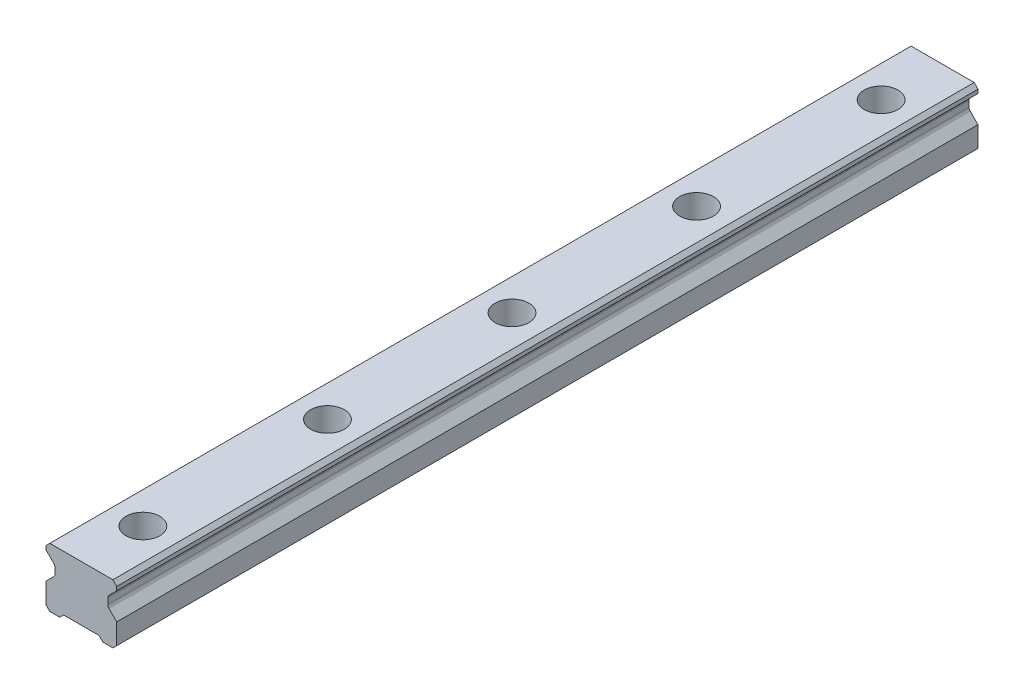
ISO-10303-21;
HEADER;
FILE_DESCRIPTION(('STEP AP214'),'2;1');
FILE_NAME('part.step','',(''),(''),'','','');
FILE_SCHEMA(('AUTOMOTIVE_DESIGN { 1 0 10303 214 1 1 1 1 }'));
ENDSEC;
DATA;
#1=APPLICATION_CONTEXT('core data for automotive mechanical design processes');
#2=APPLICATION_PROTOCOL_DEFINITION('international standard','automotive_design',2000,#1);
#3=PRODUCT_CONTEXT('',#1,'mechanical');
#4=PRODUCT('Part','Part','',(#3));
#5=PRODUCT_RELATED_PRODUCT_CATEGORY('part','',(#4));
#6=PRODUCT_DEFINITION_FORMATION('','',#4);
#7=PRODUCT_DEFINITION_CONTEXT('part definition',#1,'design');
#8=PRODUCT_DEFINITION('design','',#6,#7);
#9=PRODUCT_DEFINITION_SHAPE('','',#8);
#10=(LENGTH_UNIT() NAMED_UNIT(*) SI_UNIT(.MILLI.,.METRE.));
#11=(NAMED_UNIT(*) PLANE_ANGLE_UNIT() SI_UNIT($,.RADIAN.));
#12=(NAMED_UNIT(*) SI_UNIT($,.STERADIAN.) SOLID_ANGLE_UNIT());
#13=UNCERTAINTY_MEASURE_WITH_UNIT(LENGTH_MEASURE(1.E-05),#10,'distance_accuracy_value','');
#14=(GEOMETRIC_REPRESENTATION_CONTEXT(3) GLOBAL_UNCERTAINTY_ASSIGNED_CONTEXT((#13)) GLOBAL_UNIT_ASSIGNED_CONTEXT((#10,
#11,#12)) REPRESENTATION_CONTEXT('',''));
#15=CARTESIAN_POINT('',(0.,0.,0.));
#16=DIRECTION('',(0.,0.,1.));
#17=DIRECTION('',(1.,0.,0.));
#18=AXIS2_PLACEMENT_3D('',#15,#16,#17);
#19=CARTESIAN_POINT('',(0.,10.2,-120.));
#20=DIRECTION('',(0.,1.,0.));
#21=DIRECTION('',(0.,0.,1.));
#22=AXIS2_PLACEMENT_3D('',#19,#20,#21);
#23=PLANE('',#22);
#24=CARTESIAN_POINT('',(0.,10.2,-120.));
#25=DIRECTION('',(0.,1.,0.));
#26=DIRECTION('',(0.,0.,1.));
#27=AXIS2_PLACEMENT_3D('',#24,#25,#26);
#28=CIRCLE('',#27,3.5);
#29=CARTESIAN_POINT('',(0.,10.2,-116.5));
#30=VERTEX_POINT('',#29);
#31=EDGE_CURVE('E381',#30,#30,#28,.T.);
#32=ORIENTED_EDGE('',*,*,#31,.F.);
#33=EDGE_LOOP('',(#32));
#34=FACE_BOUND('',#33,.T.);
#35=CARTESIAN_POINT('',(0.,10.2,-120.));
#36=DIRECTION('',(0.,1.,0.));
#37=DIRECTION('',(0.,0.,1.));
#38=AXIS2_PLACEMENT_3D('',#35,#36,#37);
#39=CIRCLE('',#38,5.5);
#40=CARTESIAN_POINT('',(0.,10.2,-114.5));
#41=VERTEX_POINT('',#40);
#42=EDGE_CURVE('E11',#41,#41,#39,.T.);
#43=ORIENTED_EDGE('',*,*,#42,.T.);
#44=EDGE_LOOP('',(#43));
#45=FACE_BOUND('',#44,.T.);
#46=ADVANCED_FACE('F39',(#34,#45),#23,.T.);
#47=CARTESIAN_POINT('',(0.,10.2,-120.));
#48=DIRECTION('',(0.,1.,0.));
#49=DIRECTION('',(0.,0.,1.));
#50=AXIS2_PLACEMENT_3D('',#47,#48,#49);
#51=CYLINDRICAL_SURFACE('',#50,5.5);
#52=ORIENTED_EDGE('',*,*,#42,.F.);
#53=EDGE_LOOP('',(#52));
#54=FACE_BOUND('',#53,.T.);
#55=CARTESIAN_POINT('',(0.,19.2,-120.));
#56=DIRECTION('',(0.,1.,0.));
#57=DIRECTION('',(0.,0.,1.));
#58=AXIS2_PLACEMENT_3D('',#55,#56,#57);
#59=CIRCLE('',#58,5.5);
#60=CARTESIAN_POINT('',(0.,19.2,-114.5));
#61=VERTEX_POINT('',#60);
#62=EDGE_CURVE('E48',#61,#61,#59,.T.);
#63=ORIENTED_EDGE('',*,*,#62,.T.);
#64=EDGE_LOOP('',(#63));
#65=FACE_BOUND('',#64,.T.);
#66=ADVANCED_FACE('F635',(#54,#65),#51,.F.);
#67=CARTESIAN_POINT('',(0.,10.2,-60.));
#68=DIRECTION('',(0.,1.,0.));
#69=DIRECTION('',(0.,0.,1.));
#70=AXIS2_PLACEMENT_3D('',#67,#68,#69);
#71=PLANE('',#70);
#72=CARTESIAN_POINT('',(0.,10.2,-60.));
#73=DIRECTION('',(0.,1.,0.));
#74=DIRECTION('',(0.,0.,1.));
#75=AXIS2_PLACEMENT_3D('',#72,#73,#74);
#76=CIRCLE('',#75,3.5);
#77=CARTESIAN_POINT('',(0.,10.2,-56.5));
#78=VERTEX_POINT('',#77);
#79=EDGE_CURVE('E385',#78,#78,#76,.T.);
#80=ORIENTED_EDGE('',*,*,#79,.F.);
#81=EDGE_LOOP('',(#80));
#82=FACE_BOUND('',#81,.T.);
#83=CARTESIAN_POINT('',(0.,10.2,-60.));
#84=DIRECTION('',(0.,1.,0.));
#85=DIRECTION('',(0.,0.,1.));
#86=AXIS2_PLACEMENT_3D('',#83,#84,#85);
#87=CIRCLE('',#86,5.5);
#88=CARTESIAN_POINT('',(0.,10.2,-54.5));
#89=VERTEX_POINT('',#88);
#90=EDGE_CURVE('E366',#89,#89,#87,.T.);
#91=ORIENTED_EDGE('',*,*,#90,.T.);
#92=EDGE_LOOP('',(#91));
#93=FACE_BOUND('',#92,.T.);
#94=ADVANCED_FACE('F640',(#82,#93),#71,.T.);
#95=CARTESIAN_POINT('',(0.,10.2,-60.));
#96=DIRECTION('',(0.,1.,0.));
#97=DIRECTION('',(0.,0.,1.));
#98=AXIS2_PLACEMENT_3D('',#95,#96,#97);
#99=CYLINDRICAL_SURFACE('',#98,5.5);
#100=ORIENTED_EDGE('',*,*,#90,.F.);
#101=EDGE_LOOP('',(#100));
#102=FACE_BOUND('',#101,.T.);
#103=CARTESIAN_POINT('',(0.,19.2,-60.));
#104=DIRECTION('',(0.,1.,0.));
#105=DIRECTION('',(0.,0.,1.));
#106=AXIS2_PLACEMENT_3D('',#103,#104,#105);
#107=CIRCLE('',#106,5.5);
#108=CARTESIAN_POINT('',(0.,19.2,-54.5));
#109=VERTEX_POINT('',#108);
#110=EDGE_CURVE('E362',#109,#109,#107,.T.);
#111=ORIENTED_EDGE('',*,*,#110,.T.);
#112=EDGE_LOOP('',(#111));
#113=FACE_BOUND('',#112,.T.);
#114=ADVANCED_FACE('F685',(#102,#113),#99,.F.);
#115=CARTESIAN_POINT('',(0.,10.2,0.));
#116=DIRECTION('',(0.,1.,0.));
#117=DIRECTION('',(0.,0.,1.));
#118=AXIS2_PLACEMENT_3D('',#115,#116,#117);
#119=PLANE('',#118);
#120=CARTESIAN_POINT('',(0.,10.2,0.));
#121=DIRECTION('',(0.,1.,0.));
#122=DIRECTION('',(0.,0.,1.));
#123=AXIS2_PLACEMENT_3D('',#120,#121,#122);
#124=CIRCLE('',#123,3.5);
#125=CARTESIAN_POINT('',(0.,10.2,3.50000000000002));
#126=VERTEX_POINT('',#125);
#127=EDGE_CURVE('E399',#126,#126,#124,.T.);
#128=ORIENTED_EDGE('',*,*,#127,.F.);
#129=EDGE_LOOP('',(#128));
#130=FACE_BOUND('',#129,.T.);
#131=CARTESIAN_POINT('',(0.,10.2,0.));
#132=DIRECTION('',(0.,1.,0.));
#133=DIRECTION('',(0.,0.,1.));
#134=AXIS2_PLACEMENT_3D('',#131,#132,#133);
#135=CIRCLE('',#134,5.5);
#136=CARTESIAN_POINT('',(0.,10.2,5.50000000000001));
#137=VERTEX_POINT('',#136);
#138=EDGE_CURVE('E358',#137,#137,#135,.T.);
#139=ORIENTED_EDGE('',*,*,#138,.T.);
#140=EDGE_LOOP('',(#139));
#141=FACE_BOUND('',#140,.T.);
#142=ADVANCED_FACE('F681',(#130,#141),#119,.T.);
#143=CARTESIAN_POINT('',(0.,10.2,0.));
#144=DIRECTION('',(0.,1.,0.));
#145=DIRECTION('',(0.,0.,1.));
#146=AXIS2_PLACEMENT_3D('',#143,#144,#145);
#147=CYLINDRICAL_SURFACE('',#146,5.5);
#148=ORIENTED_EDGE('',*,*,#138,.F.);
#149=EDGE_LOOP('',(#148));
#150=FACE_BOUND('',#149,.T.);
#151=CARTESIAN_POINT('',(0.,19.2,0.));
#152=DIRECTION('',(0.,1.,0.));
#153=DIRECTION('',(0.,0.,1.));
#154=AXIS2_PLACEMENT_3D('',#151,#152,#153);
#155=CIRCLE('',#154,5.5);
#156=CARTESIAN_POINT('',(0.,19.2,5.50000000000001));
#157=VERTEX_POINT('',#156);
#158=EDGE_CURVE('E354',#157,#157,#155,.T.);
#159=ORIENTED_EDGE('',*,*,#158,.T.);
#160=EDGE_LOOP('',(#159));
#161=FACE_BOUND('',#160,.T.);
#162=ADVANCED_FACE('F678',(#150,#161),#147,.F.);
#163=CARTESIAN_POINT('',(11.5,0.,140.));
#164=DIRECTION('',(0.,1.,0.));
#165=DIRECTION('',(-1.,0.,0.));
#166=AXIS2_PLACEMENT_3D('',#163,#164,#165);
#167=PLANE('',#166);
#168=DIRECTION('',(1.,0.,0.));
#169=VECTOR('',#168,1.);
#170=CARTESIAN_POINT('',(11.5,0.,-140.));
#171=LINE('',#170,#169);
#172=CARTESIAN_POINT('',(-10.25,0.,-140.));
#173=VERTEX_POINT('',#172);
#174=CARTESIAN_POINT('',(-7.,0.,-140.));
#175=VERTEX_POINT('',#174);
#176=EDGE_CURVE('E229',#173,#175,#171,.T.);
#177=ORIENTED_EDGE('',*,*,#176,.T.);
#178=DIRECTION('',(0.,0.,1.));
#179=VECTOR('',#178,1.);
#180=CARTESIAN_POINT('',(-7.,0.,-140.));
#181=LINE('',#180,#179);
#182=CARTESIAN_POINT('',(-7.,0.,140.));
#183=VERTEX_POINT('',#182);
#184=EDGE_CURVE('E440',#175,#183,#181,.T.);
#185=ORIENTED_EDGE('',*,*,#184,.T.);
#186=DIRECTION('',(1.,0.,0.));
#187=VECTOR('',#186,1.);
#188=CARTESIAN_POINT('',(11.5,0.,140.));
#189=LINE('',#188,#187);
#190=CARTESIAN_POINT('',(-10.25,0.,140.));
#191=VERTEX_POINT('',#190);
#192=EDGE_CURVE('E510',#191,#183,#189,.T.);
#193=ORIENTED_EDGE('',*,*,#192,.F.);
#194=DIRECTION('',(0.,0.,-1.));
#195=VECTOR('',#194,1.);
#196=CARTESIAN_POINT('',(-10.25,0.,140.));
#197=LINE('',#196,#195);
#198=EDGE_CURVE('E289',#191,#173,#197,.T.);
#199=ORIENTED_EDGE('',*,*,#198,.T.);
#200=EDGE_LOOP('',(#177,#185,#193,#199));
#201=FACE_BOUND('',#200,.T.);
#202=ADVANCED_FACE('F573',(#201),#167,.F.);
#203=CARTESIAN_POINT('',(-11.5,19.2,140.));
#204=DIRECTION('',(1.,0.,0.));
#205=DIRECTION('',(0.,1.,0.));
#206=AXIS2_PLACEMENT_3D('',#203,#204,#205);
#207=PLANE('',#206);
#208=DIRECTION('',(0.,-1.,0.));
#209=VECTOR('',#208,1.);
#210=CARTESIAN_POINT('',(-11.5,19.2,140.));
#211=LINE('',#210,#209);
#212=CARTESIAN_POINT('',(-11.5,17.95,140.));
#213=VERTEX_POINT('',#212);
#214=CARTESIAN_POINT('',(-11.5,16.7,140.));
#215=VERTEX_POINT('',#214);
#216=EDGE_CURVE('E506',#213,#215,#211,.T.);
#217=ORIENTED_EDGE('',*,*,#216,.F.);
#218=DIRECTION('',(0.,0.,-1.));
#219=VECTOR('',#218,1.);
#220=CARTESIAN_POINT('',(-11.5,17.95,140.));
#221=LINE('',#220,#219);
#222=CARTESIAN_POINT('',(-11.5,17.95,-140.));
#223=VERTEX_POINT('',#222);
#224=EDGE_CURVE('E251',#213,#223,#221,.T.);
#225=ORIENTED_EDGE('',*,*,#224,.T.);
#226=DIRECTION('',(0.,-1.,0.));
#227=VECTOR('',#226,1.);
#228=CARTESIAN_POINT('',(-11.5,19.2,-140.));
#229=LINE('',#228,#227);
#230=CARTESIAN_POINT('',(-11.5,16.7,-140.));
#231=VERTEX_POINT('',#230);
#232=EDGE_CURVE('E230',#223,#231,#229,.T.);
#233=ORIENTED_EDGE('',*,*,#232,.T.);
#234=DIRECTION('',(0.,0.,1.));
#235=VECTOR('',#234,1.);
#236=CARTESIAN_POINT('',(-11.5,16.7,-140.));
#237=LINE('',#236,#235);
#238=EDGE_CURVE('E461',#231,#215,#237,.T.);
#239=ORIENTED_EDGE('',*,*,#238,.T.);
#240=EDGE_LOOP('',(#217,#225,#233,#239));
#241=FACE_BOUND('',#240,.T.);
#242=ADVANCED_FACE('F535',(#241),#207,.F.);
#243=CARTESIAN_POINT('',(11.5,19.2,140.));
#244=DIRECTION('',(-1.,0.,0.));
#245=DIRECTION('',(0.,0.,1.));
#246=AXIS2_PLACEMENT_3D('',#243,#244,#245);
#247=PLANE('',#246);
#248=DIRECTION('',(0.,1.,0.));
#249=VECTOR('',#248,1.);
#250=CARTESIAN_POINT('',(11.5,19.2,140.));
#251=LINE('',#250,#249);
#252=CARTESIAN_POINT('',(11.5,1.25,140.));
#253=VERTEX_POINT('',#252);
#254=CARTESIAN_POINT('',(11.5,7.95,140.));
#255=VERTEX_POINT('',#254);
#256=EDGE_CURVE('E515',#253,#255,#251,.T.);
#257=ORIENTED_EDGE('',*,*,#256,.F.);
#258=DIRECTION('',(0.,0.,-1.));
#259=VECTOR('',#258,1.);
#260=CARTESIAN_POINT('',(11.5,1.25,140.));
#261=LINE('',#260,#259);
#262=CARTESIAN_POINT('',(11.5,1.25,-140.));
#263=VERTEX_POINT('',#262);
#264=EDGE_CURVE('E296',#253,#263,#261,.T.);
#265=ORIENTED_EDGE('',*,*,#264,.T.);
#266=DIRECTION('',(0.,1.,0.));
#267=VECTOR('',#266,1.);
#268=CARTESIAN_POINT('',(11.5,19.2,-140.));
#269=LINE('',#268,#267);
#270=CARTESIAN_POINT('',(11.5,7.95,-140.));
#271=VERTEX_POINT('',#270);
#272=EDGE_CURVE('E242',#263,#271,#269,.T.);
#273=ORIENTED_EDGE('',*,*,#272,.T.);
#274=DIRECTION('',(0.,0.,1.));
#275=VECTOR('',#274,1.);
#276=CARTESIAN_POINT('',(11.5,7.95,-140.));
#277=LINE('',#276,#275);
#278=EDGE_CURVE('E491',#271,#255,#277,.T.);
#279=ORIENTED_EDGE('',*,*,#278,.T.);
#280=EDGE_LOOP('',(#257,#265,#273,#279));
#281=FACE_BOUND('',#280,.T.);
#282=ADVANCED_FACE('F614',(#281),#247,.F.);
#283=CARTESIAN_POINT('',(-11.5,7.95,-140.));
#284=VERTEX_POINT('',#283);
#285=CARTESIAN_POINT('',(-11.5,1.25,-140.));
#286=VERTEX_POINT('',#285);
#287=EDGE_CURVE('E238',#284,#286,#229,.T.);
#288=ORIENTED_EDGE('',*,*,#287,.T.);
#289=DIRECTION('',(0.,0.,1.));
#290=VECTOR('',#289,1.);
#291=CARTESIAN_POINT('',(-11.5,1.25,140.));
#292=LINE('',#291,#290);
#293=CARTESIAN_POINT('',(-11.5,1.25,140.));
#294=VERTEX_POINT('',#293);
#295=EDGE_CURVE('E293',#286,#294,#292,.T.);
#296=ORIENTED_EDGE('',*,*,#295,.T.);
#297=CARTESIAN_POINT('',(-11.5,7.95,140.));
#298=VERTEX_POINT('',#297);
#299=EDGE_CURVE('E250',#298,#294,#211,.T.);
#300=ORIENTED_EDGE('',*,*,#299,.F.);
#301=DIRECTION('',(0.,0.,1.));
#302=VECTOR('',#301,1.);
#303=CARTESIAN_POINT('',(-11.5,7.95,-140.));
#304=LINE('',#303,#302);
#305=EDGE_CURVE('E473',#284,#298,#304,.T.);
#306=ORIENTED_EDGE('',*,*,#305,.F.);
#307=EDGE_LOOP('',(#288,#296,#300,#306));
#308=FACE_BOUND('',#307,.T.);
#309=ADVANCED_FACE('F563',(#308),#207,.F.);
#310=CARTESIAN_POINT('',(7.,0.,140.));
#311=VERTEX_POINT('',#310);
#312=CARTESIAN_POINT('',(10.25,0.,140.));
#313=VERTEX_POINT('',#312);
#314=EDGE_CURVE('E219',#311,#313,#189,.T.);
#315=ORIENTED_EDGE('',*,*,#314,.F.);
#316=DIRECTION('',(0.,0.,1.));
#317=VECTOR('',#316,1.);
#318=CARTESIAN_POINT('',(7.,0.,-140.));
#319=LINE('',#318,#317);
#320=CARTESIAN_POINT('',(7.,0.,-140.));
#321=VERTEX_POINT('',#320);
#322=EDGE_CURVE('E206',#321,#311,#319,.T.);
#323=ORIENTED_EDGE('',*,*,#322,.F.);
#324=CARTESIAN_POINT('',(10.25,0.,-140.));
#325=VERTEX_POINT('',#324);
#326=EDGE_CURVE('E217',#321,#325,#171,.T.);
#327=ORIENTED_EDGE('',*,*,#326,.T.);
#328=DIRECTION('',(0.,0.,1.));
#329=VECTOR('',#328,1.);
#330=CARTESIAN_POINT('',(10.25,0.,140.));
#331=LINE('',#330,#329);
#332=EDGE_CURVE('E286',#325,#313,#331,.T.);
#333=ORIENTED_EDGE('',*,*,#332,.T.);
#334=EDGE_LOOP('',(#315,#323,#327,#333));
#335=FACE_BOUND('',#334,.T.);
#336=ADVANCED_FACE('F215',(#335),#167,.F.);
#337=CARTESIAN_POINT('',(11.5,16.7,-140.));
#338=VERTEX_POINT('',#337);
#339=CARTESIAN_POINT('',(11.5,17.95,-140.));
#340=VERTEX_POINT('',#339);
#341=EDGE_CURVE('E236',#338,#340,#269,.T.);
#342=ORIENTED_EDGE('',*,*,#341,.T.);
#343=DIRECTION('',(0.,0.,1.));
#344=VECTOR('',#343,1.);
#345=CARTESIAN_POINT('',(11.5,17.95,140.));
#346=LINE('',#345,#344);
#347=CARTESIAN_POINT('',(11.5,17.95,140.));
#348=VERTEX_POINT('',#347);
#349=EDGE_CURVE('E300',#340,#348,#346,.T.);
#350=ORIENTED_EDGE('',*,*,#349,.T.);
#351=CARTESIAN_POINT('',(11.5,16.7,140.));
#352=VERTEX_POINT('',#351);
#353=EDGE_CURVE('E514',#352,#348,#251,.T.);
#354=ORIENTED_EDGE('',*,*,#353,.F.);
#355=DIRECTION('',(0.,0.,1.));
#356=VECTOR('',#355,1.);
#357=CARTESIAN_POINT('',(11.5,16.7,-140.));
#358=LINE('',#357,#356);
#359=EDGE_CURVE('E466',#338,#352,#358,.T.);
#360=ORIENTED_EDGE('',*,*,#359,.F.);
#361=EDGE_LOOP('',(#342,#350,#354,#360));
#362=FACE_BOUND('',#361,.T.);
#363=ADVANCED_FACE('F590',(#362),#247,.F.);
#364=CARTESIAN_POINT('',(11.5,19.2,140.));
#365=DIRECTION('',(0.,-1.,0.));
#366=DIRECTION('',(0.,0.,-1.));
#367=AXIS2_PLACEMENT_3D('',#364,#365,#366);
#368=PLANE('',#367);
#369=CARTESIAN_POINT('',(0.,19.2,60.));
#370=DIRECTION('',(0.,1.,0.));
#371=DIRECTION('',(0.,0.,1.));
#372=AXIS2_PLACEMENT_3D('',#369,#370,#371);
#373=CIRCLE('',#372,5.5);
#374=CARTESIAN_POINT('',(0.,19.2,65.5));
#375=VERTEX_POINT('',#374);
#376=EDGE_CURVE('E403',#375,#375,#373,.T.);
#377=ORIENTED_EDGE('',*,*,#376,.F.);
#378=EDGE_LOOP('',(#377));
#379=FACE_BOUND('',#378,.T.);
#380=CARTESIAN_POINT('',(0.,19.2,120.));
#381=DIRECTION('',(0.,1.,0.));
#382=DIRECTION('',(0.,0.,1.));
#383=AXIS2_PLACEMENT_3D('',#380,#381,#382);
#384=CIRCLE('',#383,5.5);
#385=CARTESIAN_POINT('',(0.,19.2,125.5));
#386=VERTEX_POINT('',#385);
#387=EDGE_CURVE('E419',#386,#386,#384,.T.);
#388=ORIENTED_EDGE('',*,*,#387,.F.);
#389=EDGE_LOOP('',(#388));
#390=FACE_BOUND('',#389,.T.);
#391=DIRECTION('',(-1.,0.,0.));
#392=VECTOR('',#391,1.);
#393=CARTESIAN_POINT('',(11.5,19.2,-140.));
#394=LINE('',#393,#392);
#395=CARTESIAN_POINT('',(10.25,19.2,-140.));
#396=VERTEX_POINT('',#395);
#397=CARTESIAN_POINT('',(-10.25,19.2,-140.));
#398=VERTEX_POINT('',#397);
#399=EDGE_CURVE('E246',#396,#398,#394,.T.);
#400=ORIENTED_EDGE('',*,*,#399,.T.);
#401=DIRECTION('',(0.,0.,1.));
#402=VECTOR('',#401,1.);
#403=CARTESIAN_POINT('',(-10.25,19.2,140.));
#404=LINE('',#403,#402);
#405=CARTESIAN_POINT('',(-10.25,19.2,140.));
#406=VERTEX_POINT('',#405);
#407=EDGE_CURVE('E271',#398,#406,#404,.T.);
#408=ORIENTED_EDGE('',*,*,#407,.T.);
#409=DIRECTION('',(-1.,0.,0.));
#410=VECTOR('',#409,1.);
#411=CARTESIAN_POINT('',(11.5,19.2,140.));
#412=LINE('',#411,#410);
#413=CARTESIAN_POINT('',(10.25,19.2,140.));
#414=VERTEX_POINT('',#413);
#415=EDGE_CURVE('E256',#414,#406,#412,.T.);
#416=ORIENTED_EDGE('',*,*,#415,.F.);
#417=DIRECTION('',(0.,0.,-1.));
#418=VECTOR('',#417,1.);
#419=CARTESIAN_POINT('',(10.25,19.2,140.));
#420=LINE('',#419,#418);
#421=EDGE_CURVE('E267',#414,#396,#420,.T.);
#422=ORIENTED_EDGE('',*,*,#421,.T.);
#423=EDGE_LOOP('',(#400,#408,#416,#422));
#424=FACE_BOUND('',#423,.T.);
#425=ORIENTED_EDGE('',*,*,#158,.F.);
#426=EDGE_LOOP('',(#425));
#427=FACE_BOUND('',#426,.T.);
#428=ORIENTED_EDGE('',*,*,#110,.F.);
#429=EDGE_LOOP('',(#428));
#430=FACE_BOUND('',#429,.T.);
#431=ORIENTED_EDGE('',*,*,#62,.F.);
#432=EDGE_LOOP('',(#431));
#433=FACE_BOUND('',#432,.T.);
#434=ADVANCED_FACE('F586',(#379,#390,#424,#427,#430,#433),#368,.F.);
#435=CARTESIAN_POINT('',(0.,0.,140.));
#436=DIRECTION('',(0.,0.,-1.));
#437=DIRECTION('',(-1.,0.,0.));
#438=AXIS2_PLACEMENT_3D('',#435,#436,#437);
#439=PLANE('',#438);
#440=ORIENTED_EDGE('',*,*,#192,.T.);
#441=DIRECTION('',(-0.707106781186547,-0.707106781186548,0.));
#442=VECTOR('',#441,1.);
#443=CARTESIAN_POINT('',(-7.,0.,140.));
#444=LINE('',#443,#442);
#445=CARTESIAN_POINT('',(-5.75,1.25,140.));
#446=VERTEX_POINT('',#445);
#447=EDGE_CURVE('E211',#446,#183,#444,.T.);
#448=ORIENTED_EDGE('',*,*,#447,.F.);
#449=DIRECTION('',(-1.,0.,0.));
#450=VECTOR('',#449,1.);
#451=CARTESIAN_POINT('',(-5.75,1.25,140.));
#452=LINE('',#451,#450);
#453=CARTESIAN_POINT('',(5.75,1.25,140.));
#454=VERTEX_POINT('',#453);
#455=EDGE_CURVE('E434',#454,#446,#452,.T.);
#456=ORIENTED_EDGE('',*,*,#455,.F.);
#457=DIRECTION('',(-0.707106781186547,0.707106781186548,0.));
#458=VECTOR('',#457,1.);
#459=CARTESIAN_POINT('',(5.75,1.25,140.));
#460=LINE('',#459,#458);
#461=EDGE_CURVE('E424',#311,#454,#460,.T.);
#462=ORIENTED_EDGE('',*,*,#461,.F.);
#463=ORIENTED_EDGE('',*,*,#314,.T.);
#464=DIRECTION('',(-0.707106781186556,-0.707106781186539,0.));
#465=VECTOR('',#464,1.);
#466=CARTESIAN_POINT('',(11.5,1.25,140.));
#467=LINE('',#466,#465);
#468=EDGE_CURVE('E277',#313,#253,#467,.F.);
#469=ORIENTED_EDGE('',*,*,#468,.T.);
#470=ORIENTED_EDGE('',*,*,#256,.T.);
#471=DIRECTION('',(0.707106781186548,-0.707106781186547,0.));
#472=VECTOR('',#471,1.);
#473=CARTESIAN_POINT('',(11.5,7.95,140.));
#474=LINE('',#473,#472);
#475=CARTESIAN_POINT('',(8.94944985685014,10.5005501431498,140.));
#476=VERTEX_POINT('',#475);
#477=EDGE_CURVE('E444',#476,#255,#474,.T.);
#478=ORIENTED_EDGE('',*,*,#477,.F.);
#479=CARTESIAN_POINT('',(9.83333333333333,11.384433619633,140.));
#480=DIRECTION('',(0.,0.,-1.));
#481=DIRECTION('',(-1.,0.,0.));
#482=AXIS2_PLACEMENT_3D('',#479,#480,#481);
#483=CIRCLE('',#482,1.25);
#484=CARTESIAN_POINT('',(8.58333333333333,11.384433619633,140.));
#485=VERTEX_POINT('',#484);
#486=EDGE_CURVE('E331',#476,#485,#483,.T.);
#487=ORIENTED_EDGE('',*,*,#486,.T.);
#488=DIRECTION('',(0.,-1.,0.));
#489=VECTOR('',#488,1.);
#490=CARTESIAN_POINT('',(8.58333333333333,10.8666666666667,140.));
#491=LINE('',#490,#489);
#492=CARTESIAN_POINT('',(8.58333333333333,13.265566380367,140.));
#493=VERTEX_POINT('',#492);
#494=EDGE_CURVE('E483',#493,#485,#491,.T.);
#495=ORIENTED_EDGE('',*,*,#494,.F.);
#496=CARTESIAN_POINT('',(9.83333333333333,13.265566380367,140.));
#497=DIRECTION('',(0.,0.,-1.));
#498=DIRECTION('',(-1.,0.,0.));
#499=AXIS2_PLACEMENT_3D('',#496,#497,#498);
#500=CIRCLE('',#499,1.25);
#501=CARTESIAN_POINT('',(8.94944985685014,14.1494498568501,140.));
#502=VERTEX_POINT('',#501);
#503=EDGE_CURVE('E337',#493,#502,#500,.T.);
#504=ORIENTED_EDGE('',*,*,#503,.T.);
#505=DIRECTION('',(-0.707106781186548,-0.707106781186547,0.));
#506=VECTOR('',#505,1.);
#507=CARTESIAN_POINT('',(8.58333333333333,13.7833333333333,140.));
#508=LINE('',#507,#506);
#509=EDGE_CURVE('E494',#352,#502,#508,.T.);
#510=ORIENTED_EDGE('',*,*,#509,.F.);
#511=ORIENTED_EDGE('',*,*,#353,.T.);
#512=DIRECTION('',(0.707106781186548,-0.707106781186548,0.));
#513=VECTOR('',#512,1.);
#514=CARTESIAN_POINT('',(10.25,19.2,140.));
#515=LINE('',#514,#513);
#516=EDGE_CURVE('E274',#348,#414,#515,.F.);
#517=ORIENTED_EDGE('',*,*,#516,.T.);
#518=ORIENTED_EDGE('',*,*,#415,.T.);
#519=DIRECTION('',(0.707106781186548,0.707106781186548,0.));
#520=VECTOR('',#519,1.);
#521=CARTESIAN_POINT('',(-11.5,17.95,140.));
#522=LINE('',#521,#520);
#523=EDGE_CURVE('E283',#406,#213,#522,.F.);
#524=ORIENTED_EDGE('',*,*,#523,.T.);
#525=ORIENTED_EDGE('',*,*,#216,.T.);
#526=DIRECTION('',(-0.707106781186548,0.707106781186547,0.));
#527=VECTOR('',#526,1.);
#528=CARTESIAN_POINT('',(-8.58333333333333,13.7833333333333,140.));
#529=LINE('',#528,#527);
#530=CARTESIAN_POINT('',(-8.94944985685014,14.1494498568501,140.));
#531=VERTEX_POINT('',#530);
#532=EDGE_CURVE('E462',#531,#215,#529,.T.);
#533=ORIENTED_EDGE('',*,*,#532,.F.);
#534=CARTESIAN_POINT('',(-9.83333333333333,13.265566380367,140.));
#535=DIRECTION('',(0.,0.,-1.));
#536=DIRECTION('',(-1.,0.,0.));
#537=AXIS2_PLACEMENT_3D('',#534,#535,#536);
#538=CIRCLE('',#537,1.25);
#539=CARTESIAN_POINT('',(-8.58333333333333,13.265566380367,140.));
#540=VERTEX_POINT('',#539);
#541=EDGE_CURVE('E349',#531,#540,#538,.T.);
#542=ORIENTED_EDGE('',*,*,#541,.T.);
#543=DIRECTION('',(0.,1.,0.));
#544=VECTOR('',#543,1.);
#545=CARTESIAN_POINT('',(-8.58333333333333,10.8666666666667,140.));
#546=LINE('',#545,#544);
#547=CARTESIAN_POINT('',(-8.58333333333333,11.384433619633,140.));
#548=VERTEX_POINT('',#547);
#549=EDGE_CURVE('E454',#548,#540,#546,.T.);
#550=ORIENTED_EDGE('',*,*,#549,.F.);
#551=CARTESIAN_POINT('',(-9.83333333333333,11.384433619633,140.));
#552=DIRECTION('',(0.,0.,-1.));
#553=DIRECTION('',(-1.,0.,0.));
#554=AXIS2_PLACEMENT_3D('',#551,#552,#553);
#555=CIRCLE('',#554,1.25);
#556=CARTESIAN_POINT('',(-8.94944985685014,10.5005501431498,140.));
#557=VERTEX_POINT('',#556);
#558=EDGE_CURVE('E343',#548,#557,#555,.T.);
#559=ORIENTED_EDGE('',*,*,#558,.T.);
#560=DIRECTION('',(0.707106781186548,0.707106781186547,0.));
#561=VECTOR('',#560,1.);
#562=CARTESIAN_POINT('',(-11.5,7.95,140.));
#563=LINE('',#562,#561);
#564=EDGE_CURVE('E465',#298,#557,#563,.T.);
#565=ORIENTED_EDGE('',*,*,#564,.F.);
#566=ORIENTED_EDGE('',*,*,#299,.T.);
#567=DIRECTION('',(-0.707106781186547,0.707106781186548,0.));
#568=VECTOR('',#567,1.);
#569=CARTESIAN_POINT('',(-10.25,0.,140.));
#570=LINE('',#569,#568);
#571=EDGE_CURVE('E280',#294,#191,#570,.F.);
#572=ORIENTED_EDGE('',*,*,#571,.T.);
#573=EDGE_LOOP('',(#440,#448,#456,#462,#463,#469,#470,#478,#487,#495,#504,#510,#511,#517,#518,
#524,#525,#533,#542,#550,#559,#565,#566,#572));
#574=FACE_BOUND('',#573,.T.);
#575=ADVANCED_FACE('F523',(#574),#439,.F.);
#576=CARTESIAN_POINT('',(0.,0.,-140.));
#577=DIRECTION('',(0.,0.,-1.));
#578=DIRECTION('',(-1.,0.,0.));
#579=AXIS2_PLACEMENT_3D('',#576,#577,#578);
#580=PLANE('',#579);
#581=DIRECTION('',(-0.707106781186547,-0.707106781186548,0.));
#582=VECTOR('',#581,1.);
#583=CARTESIAN_POINT('',(-7.,0.,-140.));
#584=LINE('',#583,#582);
#585=CARTESIAN_POINT('',(-5.75,1.25,-140.));
#586=VERTEX_POINT('',#585);
#587=EDGE_CURVE('E221',#586,#175,#584,.T.);
#588=ORIENTED_EDGE('',*,*,#587,.T.);
#589=ORIENTED_EDGE('',*,*,#176,.F.);
#590=DIRECTION('',(0.707106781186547,-0.707106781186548,0.));
#591=VECTOR('',#590,1.);
#592=CARTESIAN_POINT('',(-5.125,-5.125,-140.));
#593=LINE('',#592,#591);
#594=EDGE_CURVE('E261',#173,#286,#593,.F.);
#595=ORIENTED_EDGE('',*,*,#594,.T.);
#596=ORIENTED_EDGE('',*,*,#287,.F.);
#597=DIRECTION('',(0.707106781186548,0.707106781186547,0.));
#598=VECTOR('',#597,1.);
#599=CARTESIAN_POINT('',(-11.5,7.95,-140.));
#600=LINE('',#599,#598);
#601=CARTESIAN_POINT('',(-8.94944985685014,10.5005501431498,-140.));
#602=VERTEX_POINT('',#601);
#603=EDGE_CURVE('E453',#284,#602,#600,.T.);
#604=ORIENTED_EDGE('',*,*,#603,.T.);
#605=CARTESIAN_POINT('',(-9.83333333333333,11.384433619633,-140.));
#606=DIRECTION('',(0.,0.,-1.));
#607=DIRECTION('',(-1.,0.,0.));
#608=AXIS2_PLACEMENT_3D('',#605,#606,#607);
#609=CIRCLE('',#608,1.25);
#610=CARTESIAN_POINT('',(-8.58333333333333,11.384433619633,-140.));
#611=VERTEX_POINT('',#610);
#612=EDGE_CURVE('E346',#602,#611,#609,.F.);
#613=ORIENTED_EDGE('',*,*,#612,.T.);
#614=DIRECTION('',(0.,1.,0.));
#615=VECTOR('',#614,1.);
#616=CARTESIAN_POINT('',(-8.58333333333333,10.8666666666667,-140.));
#617=LINE('',#616,#615);
#618=CARTESIAN_POINT('',(-8.58333333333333,13.265566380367,-140.));
#619=VERTEX_POINT('',#618);
#620=EDGE_CURVE('E458',#611,#619,#617,.T.);
#621=ORIENTED_EDGE('',*,*,#620,.T.);
#622=CARTESIAN_POINT('',(-9.83333333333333,13.265566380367,-140.));
#623=DIRECTION('',(0.,0.,-1.));
#624=DIRECTION('',(-1.,0.,0.));
#625=AXIS2_PLACEMENT_3D('',#622,#623,#624);
#626=CIRCLE('',#625,1.25);
#627=CARTESIAN_POINT('',(-8.94944985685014,14.1494498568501,-140.));
#628=VERTEX_POINT('',#627);
#629=EDGE_CURVE('E64',#619,#628,#626,.F.);
#630=ORIENTED_EDGE('',*,*,#629,.T.);
#631=DIRECTION('',(-0.707106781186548,0.707106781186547,0.));
#632=VECTOR('',#631,1.);
#633=CARTESIAN_POINT('',(-8.58333333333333,13.7833333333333,-140.));
#634=LINE('',#633,#632);
#635=EDGE_CURVE('E450',#628,#231,#634,.T.);
#636=ORIENTED_EDGE('',*,*,#635,.T.);
#637=ORIENTED_EDGE('',*,*,#232,.F.);
#638=DIRECTION('',(-0.707106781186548,-0.707106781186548,0.));
#639=VECTOR('',#638,1.);
#640=CARTESIAN_POINT('',(-14.725,14.725,-140.));
#641=LINE('',#640,#639);
#642=EDGE_CURVE('E264',#223,#398,#641,.F.);
#643=ORIENTED_EDGE('',*,*,#642,.T.);
#644=ORIENTED_EDGE('',*,*,#399,.F.);
#645=DIRECTION('',(-0.707106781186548,0.707106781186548,0.));
#646=VECTOR('',#645,1.);
#647=CARTESIAN_POINT('',(14.725,14.725,-140.));
#648=LINE('',#647,#646);
#649=EDGE_CURVE('E255',#396,#340,#648,.F.);
#650=ORIENTED_EDGE('',*,*,#649,.T.);
#651=ORIENTED_EDGE('',*,*,#341,.F.);
#652=DIRECTION('',(-0.707106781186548,-0.707106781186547,0.));
#653=VECTOR('',#652,1.);
#654=CARTESIAN_POINT('',(8.58333333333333,13.7833333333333,-140.));
#655=LINE('',#654,#653);
#656=CARTESIAN_POINT('',(8.94944985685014,14.1494498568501,-140.));
#657=VERTEX_POINT('',#656);
#658=EDGE_CURVE('E482',#338,#657,#655,.T.);
#659=ORIENTED_EDGE('',*,*,#658,.T.);
#660=CARTESIAN_POINT('',(9.83333333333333,13.265566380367,-140.));
#661=DIRECTION('',(0.,0.,-1.));
#662=DIRECTION('',(-1.,0.,0.));
#663=AXIS2_PLACEMENT_3D('',#660,#661,#662);
#664=CIRCLE('',#663,1.25);
#665=CARTESIAN_POINT('',(8.58333333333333,13.265566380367,-140.));
#666=VERTEX_POINT('',#665);
#667=EDGE_CURVE('E340',#657,#666,#664,.F.);
#668=ORIENTED_EDGE('',*,*,#667,.T.);
#669=DIRECTION('',(0.,-1.,0.));
#670=VECTOR('',#669,1.);
#671=CARTESIAN_POINT('',(8.58333333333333,10.8666666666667,-140.));
#672=LINE('',#671,#670);
#673=CARTESIAN_POINT('',(8.58333333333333,11.384433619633,-140.));
#674=VERTEX_POINT('',#673);
#675=EDGE_CURVE('E487',#666,#674,#672,.T.);
#676=ORIENTED_EDGE('',*,*,#675,.T.);
#677=CARTESIAN_POINT('',(9.83333333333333,11.384433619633,-140.));
#678=DIRECTION('',(0.,0.,-1.));
#679=DIRECTION('',(-1.,0.,0.));
#680=AXIS2_PLACEMENT_3D('',#677,#678,#679);
#681=CIRCLE('',#680,1.25);
#682=CARTESIAN_POINT('',(8.94944985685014,10.5005501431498,-140.));
#683=VERTEX_POINT('',#682);
#684=EDGE_CURVE('E334',#674,#683,#681,.F.);
#685=ORIENTED_EDGE('',*,*,#684,.T.);
#686=DIRECTION('',(0.707106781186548,-0.707106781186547,0.));
#687=VECTOR('',#686,1.);
#688=CARTESIAN_POINT('',(11.5,7.95,-140.));
#689=LINE('',#688,#687);
#690=EDGE_CURVE('E479',#683,#271,#689,.T.);
#691=ORIENTED_EDGE('',*,*,#690,.T.);
#692=ORIENTED_EDGE('',*,*,#272,.F.);
#693=DIRECTION('',(0.707106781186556,0.707106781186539,0.));
#694=VECTOR('',#693,1.);
#695=CARTESIAN_POINT('',(5.12499999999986,-5.12499999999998,-140.));
#696=LINE('',#695,#694);
#697=EDGE_CURVE('E226',#263,#325,#696,.F.);
#698=ORIENTED_EDGE('',*,*,#697,.T.);
#699=ORIENTED_EDGE('',*,*,#326,.F.);
#700=DIRECTION('',(-0.707106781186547,0.707106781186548,0.));
#701=VECTOR('',#700,1.);
#702=CARTESIAN_POINT('',(5.75,1.25,-140.));
#703=LINE('',#702,#701);
#704=CARTESIAN_POINT('',(5.75,1.25,-140.));
#705=VERTEX_POINT('',#704);
#706=EDGE_CURVE('E202',#321,#705,#703,.T.);
#707=ORIENTED_EDGE('',*,*,#706,.T.);
#708=DIRECTION('',(-1.,0.,0.));
#709=VECTOR('',#708,1.);
#710=CARTESIAN_POINT('',(-5.75,1.25,-140.));
#711=LINE('',#710,#709);
#712=EDGE_CURVE('E56',#705,#586,#711,.T.);
#713=ORIENTED_EDGE('',*,*,#712,.T.);
#714=EDGE_LOOP('',(#588,#589,#595,#596,#604,#613,#621,#630,#636,#637,#643,#644,#650,#651,#659,
#668,#676,#685,#691,#692,#698,#699,#707,#713));
#715=FACE_BOUND('',#714,.T.);
#716=ADVANCED_FACE('F224',(#715),#580,.T.);
#717=CARTESIAN_POINT('',(11.5,7.95,-140.));
#718=DIRECTION('',(-0.707106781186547,-0.707106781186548,0.));
#719=DIRECTION('',(0.707106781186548,-0.707106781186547,0.));
#720=AXIS2_PLACEMENT_3D('',#717,#718,#719);
#721=PLANE('',#720);
#722=ORIENTED_EDGE('',*,*,#690,.F.);
#723=DIRECTION('',(0.,0.,1.));
#724=VECTOR('',#723,1.);
#725=CARTESIAN_POINT('',(8.94944985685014,10.5005501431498,140.));
#726=LINE('',#725,#724);
#727=EDGE_CURVE('E303',#683,#476,#726,.T.);
#728=ORIENTED_EDGE('',*,*,#727,.T.);
#729=ORIENTED_EDGE('',*,*,#477,.T.);
#730=ORIENTED_EDGE('',*,*,#278,.F.);
#731=EDGE_LOOP('',(#722,#728,#729,#730));
#732=FACE_BOUND('',#731,.T.);
#733=ADVANCED_FACE('F610',(#732),#721,.F.);
#734=CARTESIAN_POINT('',(8.58333333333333,10.8666666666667,-140.));
#735=DIRECTION('',(-1.,0.,0.));
#736=DIRECTION('',(0.,0.,1.));
#737=AXIS2_PLACEMENT_3D('',#734,#735,#736);
#738=PLANE('',#737);
#739=ORIENTED_EDGE('',*,*,#494,.T.);
#740=DIRECTION('',(0.,0.,1.));
#741=VECTOR('',#740,1.);
#742=CARTESIAN_POINT('',(8.58333333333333,11.384433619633,-140.));
#743=LINE('',#742,#741);
#744=EDGE_CURVE('E311',#485,#674,#743,.F.);
#745=ORIENTED_EDGE('',*,*,#744,.T.);
#746=ORIENTED_EDGE('',*,*,#675,.F.);
#747=DIRECTION('',(0.,0.,1.));
#748=VECTOR('',#747,1.);
#749=CARTESIAN_POINT('',(8.58333333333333,13.265566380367,140.));
#750=LINE('',#749,#748);
#751=EDGE_CURVE('E307',#666,#493,#750,.T.);
#752=ORIENTED_EDGE('',*,*,#751,.T.);
#753=EDGE_LOOP('',(#739,#745,#746,#752));
#754=FACE_BOUND('',#753,.T.);
#755=ADVANCED_FACE('F601',(#754),#738,.F.);
#756=CARTESIAN_POINT('',(8.58333333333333,13.7833333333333,-140.));
#757=DIRECTION('',(-0.707106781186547,0.707106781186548,0.));
#758=DIRECTION('',(-0.707106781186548,-0.707106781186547,0.));
#759=AXIS2_PLACEMENT_3D('',#756,#757,#758);
#760=PLANE('',#759);
#761=ORIENTED_EDGE('',*,*,#509,.T.);
#762=DIRECTION('',(0.,0.,1.));
#763=VECTOR('',#762,1.);
#764=CARTESIAN_POINT('',(8.94944985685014,14.1494498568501,-140.));
#765=LINE('',#764,#763);
#766=EDGE_CURVE('E314',#502,#657,#765,.F.);
#767=ORIENTED_EDGE('',*,*,#766,.T.);
#768=ORIENTED_EDGE('',*,*,#658,.F.);
#769=ORIENTED_EDGE('',*,*,#359,.T.);
#770=EDGE_LOOP('',(#761,#767,#768,#769));
#771=FACE_BOUND('',#770,.T.);
#772=ADVANCED_FACE('F592',(#771),#760,.F.);
#773=CARTESIAN_POINT('',(-8.58333333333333,13.7833333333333,-140.));
#774=DIRECTION('',(0.707106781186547,0.707106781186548,0.));
#775=DIRECTION('',(-0.707106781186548,0.707106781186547,0.));
#776=AXIS2_PLACEMENT_3D('',#773,#774,#775);
#777=PLANE('',#776);
#778=ORIENTED_EDGE('',*,*,#635,.F.);
#779=DIRECTION('',(0.,0.,1.));
#780=VECTOR('',#779,1.);
#781=CARTESIAN_POINT('',(-8.94944985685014,14.1494498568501,140.));
#782=LINE('',#781,#780);
#783=EDGE_CURVE('E327',#628,#531,#782,.T.);
#784=ORIENTED_EDGE('',*,*,#783,.T.);
#785=ORIENTED_EDGE('',*,*,#532,.T.);
#786=ORIENTED_EDGE('',*,*,#238,.F.);
#787=EDGE_LOOP('',(#778,#784,#785,#786));
#788=FACE_BOUND('',#787,.T.);
#789=ADVANCED_FACE('F540',(#788),#777,.F.);
#790=CARTESIAN_POINT('',(-8.58333333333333,10.8666666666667,-140.));
#791=DIRECTION('',(1.,0.,0.));
#792=DIRECTION('',(0.,0.,-1.));
#793=AXIS2_PLACEMENT_3D('',#790,#791,#792);
#794=PLANE('',#793);
#795=ORIENTED_EDGE('',*,*,#620,.F.);
#796=DIRECTION('',(0.,0.,1.));
#797=VECTOR('',#796,1.);
#798=CARTESIAN_POINT('',(-8.58333333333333,11.384433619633,140.));
#799=LINE('',#798,#797);
#800=EDGE_CURVE('E320',#611,#548,#799,.T.);
#801=ORIENTED_EDGE('',*,*,#800,.T.);
#802=ORIENTED_EDGE('',*,*,#549,.T.);
#803=DIRECTION('',(0.,0.,1.));
#804=VECTOR('',#803,1.);
#805=CARTESIAN_POINT('',(-8.58333333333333,13.265566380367,-140.));
#806=LINE('',#805,#804);
#807=EDGE_CURVE('E317',#540,#619,#806,.F.);
#808=ORIENTED_EDGE('',*,*,#807,.T.);
#809=EDGE_LOOP('',(#795,#801,#802,#808));
#810=FACE_BOUND('',#809,.T.);
#811=ADVANCED_FACE('F548',(#810),#794,.F.);
#812=CARTESIAN_POINT('',(-11.5,7.95,-140.));
#813=DIRECTION('',(0.707106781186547,-0.707106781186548,0.));
#814=DIRECTION('',(0.707106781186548,0.707106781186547,0.));
#815=AXIS2_PLACEMENT_3D('',#812,#813,#814);
#816=PLANE('',#815);
#817=ORIENTED_EDGE('',*,*,#564,.T.);
#818=DIRECTION('',(0.,0.,1.));
#819=VECTOR('',#818,1.);
#820=CARTESIAN_POINT('',(-8.94944985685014,10.5005501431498,-140.));
#821=LINE('',#820,#819);
#822=EDGE_CURVE('E324',#557,#602,#821,.F.);
#823=ORIENTED_EDGE('',*,*,#822,.T.);
#824=ORIENTED_EDGE('',*,*,#603,.F.);
#825=ORIENTED_EDGE('',*,*,#305,.T.);
#826=EDGE_LOOP('',(#817,#823,#824,#825));
#827=FACE_BOUND('',#826,.T.);
#828=ADVANCED_FACE('F558',(#827),#816,.F.);
#829=CARTESIAN_POINT('',(-11.5,17.95,140.));
#830=DIRECTION('',(0.707106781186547,-0.707106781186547,0.));
#831=DIRECTION('',(0.,0.,-1.));
#832=AXIS2_PLACEMENT_3D('',#829,#830,#831);
#833=PLANE('',#832);
#834=ORIENTED_EDGE('',*,*,#523,.F.);
#835=ORIENTED_EDGE('',*,*,#407,.F.);
#836=ORIENTED_EDGE('',*,*,#642,.F.);
#837=ORIENTED_EDGE('',*,*,#224,.F.);
#838=EDGE_LOOP('',(#834,#835,#836,#837));
#839=FACE_BOUND('',#838,.T.);
#840=ADVANCED_FACE('F532',(#839),#833,.F.);
#841=CARTESIAN_POINT('',(-10.25,0.,140.));
#842=DIRECTION('',(0.707106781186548,0.707106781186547,0.));
#843=DIRECTION('',(0.,0.,-1.));
#844=AXIS2_PLACEMENT_3D('',#841,#842,#843);
#845=PLANE('',#844);
#846=ORIENTED_EDGE('',*,*,#571,.F.);
#847=ORIENTED_EDGE('',*,*,#295,.F.);
#848=ORIENTED_EDGE('',*,*,#594,.F.);
#849=ORIENTED_EDGE('',*,*,#198,.F.);
#850=EDGE_LOOP('',(#846,#847,#848,#849));
#851=FACE_BOUND('',#850,.T.);
#852=ADVANCED_FACE('F570',(#851),#845,.F.);
#853=CARTESIAN_POINT('',(11.5,1.25,140.));
#854=DIRECTION('',(-0.707106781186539,0.707106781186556,0.));
#855=DIRECTION('',(0.,0.,-1.));
#856=AXIS2_PLACEMENT_3D('',#853,#854,#855);
#857=PLANE('',#856);
#858=ORIENTED_EDGE('',*,*,#468,.F.);
#859=ORIENTED_EDGE('',*,*,#332,.F.);
#860=ORIENTED_EDGE('',*,*,#697,.F.);
#861=ORIENTED_EDGE('',*,*,#264,.F.);
#862=EDGE_LOOP('',(#858,#859,#860,#861));
#863=FACE_BOUND('',#862,.T.);
#864=ADVANCED_FACE('F618',(#863),#857,.F.);
#865=CARTESIAN_POINT('',(10.25,19.2,140.));
#866=DIRECTION('',(-0.707106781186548,-0.707106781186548,0.));
#867=DIRECTION('',(0.,0.,-1.));
#868=AXIS2_PLACEMENT_3D('',#865,#866,#867);
#869=PLANE('',#868);
#870=ORIENTED_EDGE('',*,*,#516,.F.);
#871=ORIENTED_EDGE('',*,*,#349,.F.);
#872=ORIENTED_EDGE('',*,*,#649,.F.);
#873=ORIENTED_EDGE('',*,*,#421,.F.);
#874=EDGE_LOOP('',(#870,#871,#872,#873));
#875=FACE_BOUND('',#874,.T.);
#876=ADVANCED_FACE('F585',(#875),#869,.F.);
#877=CARTESIAN_POINT('',(9.83333333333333,11.384433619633,-140.));
#878=DIRECTION('',(0.,0.,-1.));
#879=DIRECTION('',(-1.,0.,0.));
#880=AXIS2_PLACEMENT_3D('',#877,#878,#879);
#881=CYLINDRICAL_SURFACE('',#880,1.25);
#882=ORIENTED_EDGE('',*,*,#684,.F.);
#883=ORIENTED_EDGE('',*,*,#744,.F.);
#884=ORIENTED_EDGE('',*,*,#486,.F.);
#885=ORIENTED_EDGE('',*,*,#727,.F.);
#886=EDGE_LOOP('',(#882,#883,#884,#885));
#887=FACE_BOUND('',#886,.T.);
#888=ADVANCED_FACE('F607',(#887),#881,.F.);
#889=CARTESIAN_POINT('',(9.83333333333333,13.265566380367,-140.));
#890=DIRECTION('',(0.,0.,-1.));
#891=DIRECTION('',(-1.,0.,0.));
#892=AXIS2_PLACEMENT_3D('',#889,#890,#891);
#893=CYLINDRICAL_SURFACE('',#892,1.25);
#894=ORIENTED_EDGE('',*,*,#667,.F.);
#895=ORIENTED_EDGE('',*,*,#766,.F.);
#896=ORIENTED_EDGE('',*,*,#503,.F.);
#897=ORIENTED_EDGE('',*,*,#751,.F.);
#898=EDGE_LOOP('',(#894,#895,#896,#897));
#899=FACE_BOUND('',#898,.T.);
#900=ADVANCED_FACE('F598',(#899),#893,.F.);
#901=CARTESIAN_POINT('',(-9.83333333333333,11.384433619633,-140.));
#902=DIRECTION('',(0.,0.,-1.));
#903=DIRECTION('',(-1.,0.,0.));
#904=AXIS2_PLACEMENT_3D('',#901,#902,#903);
#905=CYLINDRICAL_SURFACE('',#904,1.25);
#906=ORIENTED_EDGE('',*,*,#612,.F.);
#907=ORIENTED_EDGE('',*,*,#822,.F.);
#908=ORIENTED_EDGE('',*,*,#558,.F.);
#909=ORIENTED_EDGE('',*,*,#800,.F.);
#910=EDGE_LOOP('',(#906,#907,#908,#909));
#911=FACE_BOUND('',#910,.T.);
#912=ADVANCED_FACE('F552',(#911),#905,.F.);
#913=CARTESIAN_POINT('',(-9.83333333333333,13.265566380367,-140.));
#914=DIRECTION('',(0.,0.,-1.));
#915=DIRECTION('',(-1.,0.,0.));
#916=AXIS2_PLACEMENT_3D('',#913,#914,#915);
#917=CYLINDRICAL_SURFACE('',#916,1.25);
#918=ORIENTED_EDGE('',*,*,#629,.F.);
#919=ORIENTED_EDGE('',*,*,#807,.F.);
#920=ORIENTED_EDGE('',*,*,#541,.F.);
#921=ORIENTED_EDGE('',*,*,#783,.F.);
#922=EDGE_LOOP('',(#918,#919,#920,#921));
#923=FACE_BOUND('',#922,.T.);
#924=ADVANCED_FACE('F543',(#923),#917,.F.);
#925=CARTESIAN_POINT('',(-7.,0.,-140.));
#926=DIRECTION('',(-0.707106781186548,0.707106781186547,0.));
#927=DIRECTION('',(-0.707106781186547,-0.707106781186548,0.));
#928=AXIS2_PLACEMENT_3D('',#925,#926,#927);
#929=PLANE('',#928);
#930=ORIENTED_EDGE('',*,*,#447,.T.);
#931=ORIENTED_EDGE('',*,*,#184,.F.);
#932=ORIENTED_EDGE('',*,*,#587,.F.);
#933=DIRECTION('',(0.,0.,1.));
#934=VECTOR('',#933,1.);
#935=CARTESIAN_POINT('',(-5.75,1.25,-140.));
#936=LINE('',#935,#934);
#937=EDGE_CURVE('E445',#586,#446,#936,.T.);
#938=ORIENTED_EDGE('',*,*,#937,.T.);
#939=EDGE_LOOP('',(#930,#931,#932,#938));
#940=FACE_BOUND('',#939,.T.);
#941=ADVANCED_FACE('F623',(#940),#929,.F.);
#942=CARTESIAN_POINT('',(-5.75,1.25,-140.));
#943=DIRECTION('',(0.,1.,0.));
#944=DIRECTION('',(0.,0.,1.));
#945=AXIS2_PLACEMENT_3D('',#942,#943,#944);
#946=PLANE('',#945);
#947=CARTESIAN_POINT('',(0.,1.25,60.));
#948=DIRECTION('',(0.,1.,0.));
#949=DIRECTION('',(0.,0.,1.));
#950=AXIS2_PLACEMENT_3D('',#947,#948,#949);
#951=CIRCLE('',#950,3.5);
#952=CARTESIAN_POINT('',(0.,1.25,63.5));
#953=VERTEX_POINT('',#952);
#954=EDGE_CURVE('E377',#953,#953,#951,.T.);
#955=ORIENTED_EDGE('',*,*,#954,.T.);
#956=EDGE_LOOP('',(#955));
#957=FACE_BOUND('',#956,.T.);
#958=CARTESIAN_POINT('',(0.,1.25,0.));
#959=DIRECTION('',(0.,1.,0.));
#960=DIRECTION('',(0.,0.,1.));
#961=AXIS2_PLACEMENT_3D('',#958,#959,#960);
#962=CIRCLE('',#961,3.5);
#963=CARTESIAN_POINT('',(0.,1.25,3.50000000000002));
#964=VERTEX_POINT('',#963);
#965=EDGE_CURVE('E42',#964,#964,#962,.T.);
#966=ORIENTED_EDGE('',*,*,#965,.T.);
#967=EDGE_LOOP('',(#966));
#968=FACE_BOUND('',#967,.T.);
#969=CARTESIAN_POINT('',(0.,1.25,-60.));
#970=DIRECTION('',(0.,1.,0.));
#971=DIRECTION('',(0.,0.,1.));
#972=AXIS2_PLACEMENT_3D('',#969,#970,#971);
#973=CIRCLE('',#972,3.5);
#974=CARTESIAN_POINT('',(0.,1.25,-56.5));
#975=VERTEX_POINT('',#974);
#976=EDGE_CURVE('E382',#975,#975,#973,.T.);
#977=ORIENTED_EDGE('',*,*,#976,.T.);
#978=EDGE_LOOP('',(#977));
#979=FACE_BOUND('',#978,.T.);
#980=CARTESIAN_POINT('',(0.,1.25,-120.));
#981=DIRECTION('',(0.,1.,0.));
#982=DIRECTION('',(0.,0.,1.));
#983=AXIS2_PLACEMENT_3D('',#980,#981,#982);
#984=CIRCLE('',#983,3.5);
#985=CARTESIAN_POINT('',(0.,1.25,-116.5));
#986=VERTEX_POINT('',#985);
#987=EDGE_CURVE('E378',#986,#986,#984,.T.);
#988=ORIENTED_EDGE('',*,*,#987,.T.);
#989=EDGE_LOOP('',(#988));
#990=FACE_BOUND('',#989,.T.);
#991=CARTESIAN_POINT('',(0.,1.25,120.));
#992=DIRECTION('',(0.,1.,0.));
#993=DIRECTION('',(0.,0.,1.));
#994=AXIS2_PLACEMENT_3D('',#991,#992,#993);
#995=CIRCLE('',#994,3.5);
#996=CARTESIAN_POINT('',(0.,1.25,123.5));
#997=VERTEX_POINT('',#996);
#998=EDGE_CURVE('E415',#997,#997,#995,.T.);
#999=ORIENTED_EDGE('',*,*,#998,.T.);
#1000=EDGE_LOOP('',(#999));
#1001=FACE_BOUND('',#1000,.T.);
#1002=ORIENTED_EDGE('',*,*,#455,.T.);
#1003=ORIENTED_EDGE('',*,*,#937,.F.);
#1004=ORIENTED_EDGE('',*,*,#712,.F.);
#1005=DIRECTION('',(0.,0.,1.));
#1006=VECTOR('',#1005,1.);
#1007=CARTESIAN_POINT('',(5.75,1.25,-140.));
#1008=LINE('',#1007,#1006);
#1009=EDGE_CURVE('E208',#705,#454,#1008,.T.);
#1010=ORIENTED_EDGE('',*,*,#1009,.T.);
#1011=EDGE_LOOP('',(#1002,#1003,#1004,#1010));
#1012=FACE_BOUND('',#1011,.T.);
#1013=ADVANCED_FACE('F620',(#957,#968,#979,#990,#1001,#1012),#946,.F.);
#1014=CARTESIAN_POINT('',(5.75,1.25,-140.));
#1015=DIRECTION('',(0.707106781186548,0.707106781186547,0.));
#1016=DIRECTION('',(-0.707106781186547,0.707106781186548,0.));
#1017=AXIS2_PLACEMENT_3D('',#1014,#1015,#1016);
#1018=PLANE('',#1017);
#1019=ORIENTED_EDGE('',*,*,#461,.T.);
#1020=ORIENTED_EDGE('',*,*,#1009,.F.);
#1021=ORIENTED_EDGE('',*,*,#706,.F.);
#1022=ORIENTED_EDGE('',*,*,#322,.T.);
#1023=EDGE_LOOP('',(#1019,#1020,#1021,#1022));
#1024=FACE_BOUND('',#1023,.T.);
#1025=ADVANCED_FACE('F205',(#1024),#1018,.F.);
#1026=CARTESIAN_POINT('',(0.,10.2,120.));
#1027=DIRECTION('',(0.,1.,0.));
#1028=DIRECTION('',(0.,0.,1.));
#1029=AXIS2_PLACEMENT_3D('',#1026,#1027,#1028);
#1030=CYLINDRICAL_SURFACE('',#1029,5.5);
#1031=CARTESIAN_POINT('',(0.,10.2,120.));
#1032=DIRECTION('',(0.,1.,0.));
#1033=DIRECTION('',(0.,0.,1.));
#1034=AXIS2_PLACEMENT_3D('',#1031,#1032,#1033);
#1035=CIRCLE('',#1034,5.5);
#1036=CARTESIAN_POINT('',(0.,10.2,125.5));
#1037=VERTEX_POINT('',#1036);
#1038=EDGE_CURVE('E420',#1037,#1037,#1035,.T.);
#1039=ORIENTED_EDGE('',*,*,#1038,.F.);
#1040=EDGE_LOOP('',(#1039));
#1041=FACE_BOUND('',#1040,.T.);
#1042=ORIENTED_EDGE('',*,*,#387,.T.);
#1043=EDGE_LOOP('',(#1042));
#1044=FACE_BOUND('',#1043,.T.);
#1045=ADVANCED_FACE('F731',(#1041,#1044),#1030,.F.);
#1046=CARTESIAN_POINT('',(0.,10.2,120.));
#1047=DIRECTION('',(0.,1.,0.));
#1048=DIRECTION('',(0.,0.,1.));
#1049=AXIS2_PLACEMENT_3D('',#1046,#1047,#1048);
#1050=PLANE('',#1049);
#1051=CARTESIAN_POINT('',(0.,10.2,120.));
#1052=DIRECTION('',(0.,1.,0.));
#1053=DIRECTION('',(0.,0.,1.));
#1054=AXIS2_PLACEMENT_3D('',#1051,#1052,#1053);
#1055=CIRCLE('',#1054,3.5);
#1056=CARTESIAN_POINT('',(0.,10.2,123.5));
#1057=VERTEX_POINT('',#1056);
#1058=EDGE_CURVE('E411',#1057,#1057,#1055,.T.);
#1059=ORIENTED_EDGE('',*,*,#1058,.F.);
#1060=EDGE_LOOP('',(#1059));
#1061=FACE_BOUND('',#1060,.T.);
#1062=ORIENTED_EDGE('',*,*,#1038,.T.);
#1063=EDGE_LOOP('',(#1062));
#1064=FACE_BOUND('',#1063,.T.);
#1065=ADVANCED_FACE('F728',(#1061,#1064),#1050,.T.);
#1066=CARTESIAN_POINT('',(0.,0.,120.));
#1067=DIRECTION('',(0.,1.,0.));
#1068=DIRECTION('',(0.,0.,1.));
#1069=AXIS2_PLACEMENT_3D('',#1066,#1067,#1068);
#1070=CYLINDRICAL_SURFACE('',#1069,3.5);
#1071=ORIENTED_EDGE('',*,*,#1058,.T.);
#1072=EDGE_LOOP('',(#1071));
#1073=FACE_BOUND('',#1072,.T.);
#1074=ORIENTED_EDGE('',*,*,#998,.F.);
#1075=EDGE_LOOP('',(#1074));
#1076=FACE_BOUND('',#1075,.T.);
#1077=ADVANCED_FACE('F724',(#1073,#1076),#1070,.F.);
#1078=CARTESIAN_POINT('',(0.,10.2,60.));
#1079=DIRECTION('',(0.,1.,0.));
#1080=DIRECTION('',(0.,0.,1.));
#1081=AXIS2_PLACEMENT_3D('',#1078,#1079,#1080);
#1082=CYLINDRICAL_SURFACE('',#1081,5.5);
#1083=CARTESIAN_POINT('',(0.,10.2,60.));
#1084=DIRECTION('',(0.,1.,0.));
#1085=DIRECTION('',(0.,0.,1.));
#1086=AXIS2_PLACEMENT_3D('',#1083,#1084,#1085);
#1087=CIRCLE('',#1086,5.5);
#1088=CARTESIAN_POINT('',(0.,10.2,65.5));
#1089=VERTEX_POINT('',#1088);
#1090=EDGE_CURVE('E407',#1089,#1089,#1087,.T.);
#1091=ORIENTED_EDGE('',*,*,#1090,.F.);
#1092=EDGE_LOOP('',(#1091));
#1093=FACE_BOUND('',#1092,.T.);
#1094=ORIENTED_EDGE('',*,*,#376,.T.);
#1095=EDGE_LOOP('',(#1094));
#1096=FACE_BOUND('',#1095,.T.);
#1097=ADVANCED_FACE('F720',(#1093,#1096),#1082,.F.);
#1098=CARTESIAN_POINT('',(0.,10.2,60.));
#1099=DIRECTION('',(0.,1.,0.));
#1100=DIRECTION('',(0.,0.,1.));
#1101=AXIS2_PLACEMENT_3D('',#1098,#1099,#1100);
#1102=PLANE('',#1101);
#1103=CARTESIAN_POINT('',(0.,10.2,60.));
#1104=DIRECTION('',(0.,1.,0.));
#1105=DIRECTION('',(0.,0.,1.));
#1106=AXIS2_PLACEMENT_3D('',#1103,#1104,#1105);
#1107=CIRCLE('',#1106,3.5);
#1108=CARTESIAN_POINT('',(0.,10.2,63.5));
#1109=VERTEX_POINT('',#1108);
#1110=EDGE_CURVE('E373',#1109,#1109,#1107,.T.);
#1111=ORIENTED_EDGE('',*,*,#1110,.F.);
#1112=EDGE_LOOP('',(#1111));
#1113=FACE_BOUND('',#1112,.T.);
#1114=ORIENTED_EDGE('',*,*,#1090,.T.);
#1115=EDGE_LOOP('',(#1114));
#1116=FACE_BOUND('',#1115,.T.);
#1117=ADVANCED_FACE('F717',(#1113,#1116),#1102,.T.);
#1118=CARTESIAN_POINT('',(0.,0.,60.));
#1119=DIRECTION('',(0.,1.,0.));
#1120=DIRECTION('',(0.,0.,1.));
#1121=AXIS2_PLACEMENT_3D('',#1118,#1119,#1120);
#1122=CYLINDRICAL_SURFACE('',#1121,3.5);
#1123=ORIENTED_EDGE('',*,*,#1110,.T.);
#1124=EDGE_LOOP('',(#1123));
#1125=FACE_BOUND('',#1124,.T.);
#1126=ORIENTED_EDGE('',*,*,#954,.F.);
#1127=EDGE_LOOP('',(#1126));
#1128=FACE_BOUND('',#1127,.T.);
#1129=ADVANCED_FACE('F713',(#1125,#1128),#1122,.F.);
#1130=CARTESIAN_POINT('',(0.,0.,-120.));
#1131=DIRECTION('',(0.,1.,0.));
#1132=DIRECTION('',(0.,0.,1.));
#1133=AXIS2_PLACEMENT_3D('',#1130,#1131,#1132);
#1134=CYLINDRICAL_SURFACE('',#1133,3.5);
#1135=ORIENTED_EDGE('',*,*,#31,.T.);
#1136=EDGE_LOOP('',(#1135));
#1137=FACE_BOUND('',#1136,.T.);
#1138=ORIENTED_EDGE('',*,*,#987,.F.);
#1139=EDGE_LOOP('',(#1138));
#1140=FACE_BOUND('',#1139,.T.);
#1141=ADVANCED_FACE('F705',(#1137,#1140),#1134,.F.);
#1142=CARTESIAN_POINT('',(0.,0.,-60.));
#1143=DIRECTION('',(0.,1.,0.));
#1144=DIRECTION('',(0.,0.,1.));
#1145=AXIS2_PLACEMENT_3D('',#1142,#1143,#1144);
#1146=CYLINDRICAL_SURFACE('',#1145,3.5);
#1147=ORIENTED_EDGE('',*,*,#79,.T.);
#1148=EDGE_LOOP('',(#1147));
#1149=FACE_BOUND('',#1148,.T.);
#1150=ORIENTED_EDGE('',*,*,#976,.F.);
#1151=EDGE_LOOP('',(#1150));
#1152=FACE_BOUND('',#1151,.T.);
#1153=ADVANCED_FACE('F701',(#1149,#1152),#1146,.F.);
#1154=CARTESIAN_POINT('',(0.,0.,0.));
#1155=DIRECTION('',(0.,1.,0.));
#1156=DIRECTION('',(0.,0.,1.));
#1157=AXIS2_PLACEMENT_3D('',#1154,#1155,#1156);
#1158=CYLINDRICAL_SURFACE('',#1157,3.5);
#1159=ORIENTED_EDGE('',*,*,#127,.T.);
#1160=EDGE_LOOP('',(#1159));
#1161=FACE_BOUND('',#1160,.T.);
#1162=ORIENTED_EDGE('',*,*,#965,.F.);
#1163=EDGE_LOOP('',(#1162));
#1164=FACE_BOUND('',#1163,.T.);
#1165=ADVANCED_FACE('F704',(#1161,#1164),#1158,.F.);
#1166=CLOSED_SHELL('',(#46,#66,#94,#114,#142,#162,#202,#242,#282,#309,#336,#363,#434,#575,#716,
#733,#755,#772,#789,#811,#828,#840,#852,#864,#876,#888,#900,#912,#924,#941,#1013,#1025,#1045,
#1065,#1077,#1097,#1117,#1129,#1141,#1153,#1165));
#1167=MANIFOLD_SOLID_BREP('B2',#1166);
#1168=ADVANCED_BREP_SHAPE_REPRESENTATION('',(#18,#1167),#14);
#1169=SHAPE_DEFINITION_REPRESENTATION(#9,#1168);
ENDSEC;
END-ISO-10303-21;
